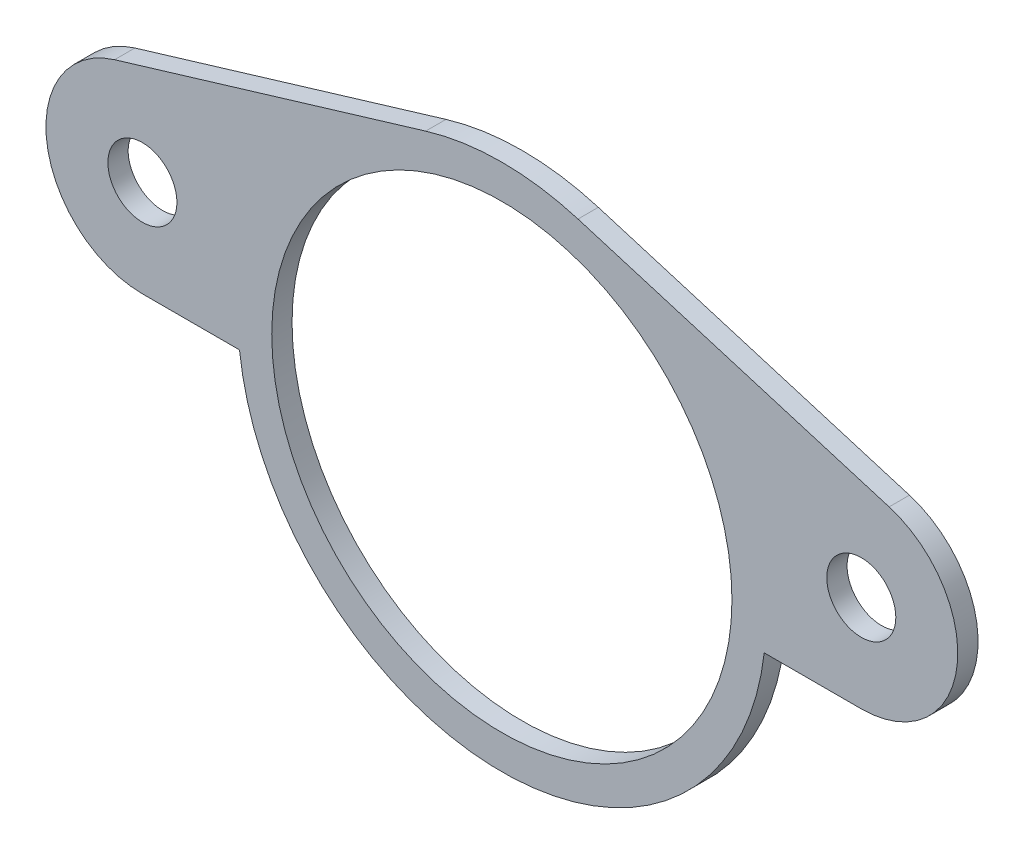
ISO-10303-21;
HEADER;
FILE_DESCRIPTION(('STEP AP214'),'2;1');
FILE_NAME('part.step','',(''),(''),'','','');
FILE_SCHEMA(('AUTOMOTIVE_DESIGN { 1 0 10303 214 1 1 1 1 }'));
ENDSEC;
DATA;
#1=APPLICATION_CONTEXT('core data for automotive mechanical design processes');
#2=APPLICATION_PROTOCOL_DEFINITION('international standard','automotive_design',2000,#1);
#3=PRODUCT_CONTEXT('',#1,'mechanical');
#4=PRODUCT('Part','Part','',(#3));
#5=PRODUCT_RELATED_PRODUCT_CATEGORY('part','',(#4));
#6=PRODUCT_DEFINITION_FORMATION('','',#4);
#7=PRODUCT_DEFINITION_CONTEXT('part definition',#1,'design');
#8=PRODUCT_DEFINITION('design','',#6,#7);
#9=PRODUCT_DEFINITION_SHAPE('','',#8);
#10=(LENGTH_UNIT() NAMED_UNIT(*) SI_UNIT(.MILLI.,.METRE.));
#11=(NAMED_UNIT(*) PLANE_ANGLE_UNIT() SI_UNIT($,.RADIAN.));
#12=(NAMED_UNIT(*) SI_UNIT($,.STERADIAN.) SOLID_ANGLE_UNIT());
#13=UNCERTAINTY_MEASURE_WITH_UNIT(LENGTH_MEASURE(1.E-05),#10,'distance_accuracy_value','');
#14=(GEOMETRIC_REPRESENTATION_CONTEXT(3) GLOBAL_UNCERTAINTY_ASSIGNED_CONTEXT((#13)) GLOBAL_UNIT_ASSIGNED_CONTEXT((#10,
#11,#12)) REPRESENTATION_CONTEXT('',''));
#15=CARTESIAN_POINT('',(0.,0.,0.));
#16=DIRECTION('',(0.,0.,1.));
#17=DIRECTION('',(1.,0.,0.));
#18=AXIS2_PLACEMENT_3D('',#15,#16,#17);
#19=CARTESIAN_POINT('',(-17.6978406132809,3.28427124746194,1.));
#20=DIRECTION('',(0.,0.,1.));
#21=DIRECTION('',(1.,0.,0.));
#22=AXIS2_PLACEMENT_3D('',#19,#20,#21);
#23=PLANE('',#22);
#24=CARTESIAN_POINT('',(17.6978406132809,3.28427124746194,1.));
#25=DIRECTION('',(0.,0.,1.));
#26=DIRECTION('',(1.,0.,0.));
#27=AXIS2_PLACEMENT_3D('',#24,#25,#26);
#28=CIRCLE('',#27,1.7);
#29=CARTESIAN_POINT('',(19.3978406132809,3.28427124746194,1.));
#30=VERTEX_POINT('',#29);
#31=EDGE_CURVE('E191',#30,#30,#28,.T.);
#32=ORIENTED_EDGE('',*,*,#31,.F.);
#33=EDGE_LOOP('',(#32));
#34=FACE_BOUND('',#33,.T.);
#35=CARTESIAN_POINT('',(-17.6978406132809,3.28427124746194,1.));
#36=DIRECTION('',(0.,0.,1.));
#37=DIRECTION('',(1.,0.,0.));
#38=AXIS2_PLACEMENT_3D('',#35,#36,#37);
#39=CIRCLE('',#38,4.75);
#40=CARTESIAN_POINT('',(-19.0680874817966,7.83233935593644,1.));
#41=VERTEX_POINT('',#40);
#42=CARTESIAN_POINT('',(-17.6978406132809,-1.46572875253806,1.));
#43=VERTEX_POINT('',#42);
#44=EDGE_CURVE('E154',#41,#43,#39,.T.);
#45=ORIENTED_EDGE('',*,*,#44,.T.);
#46=DIRECTION('',(1.,0.,0.));
#47=VECTOR('',#46,1.);
#48=CARTESIAN_POINT('',(-12.9171064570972,-1.46572875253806,1.));
#49=LINE('',#48,#47);
#50=CARTESIAN_POINT('',(-12.9171064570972,-1.46572875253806,1.));
#51=VERTEX_POINT('',#50);
#52=EDGE_CURVE('E102',#43,#51,#49,.T.);
#53=ORIENTED_EDGE('',*,*,#52,.T.);
#54=CARTESIAN_POINT('',(0.,0.,1.));
#55=DIRECTION('',(0.,0.,1.));
#56=DIRECTION('',(-1.,0.,0.));
#57=AXIS2_PLACEMENT_3D('',#54,#55,#56);
#58=CIRCLE('',#57,13.);
#59=CARTESIAN_POINT('',(12.9171064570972,-1.46572875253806,1.));
#60=VERTEX_POINT('',#59);
#61=EDGE_CURVE('E169',#51,#60,#58,.T.);
#62=ORIENTED_EDGE('',*,*,#61,.T.);
#63=DIRECTION('',(1.,0.,0.));
#64=VECTOR('',#63,1.);
#65=CARTESIAN_POINT('',(12.9171064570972,-1.46572875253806,1.));
#66=LINE('',#65,#64);
#67=CARTESIAN_POINT('',(17.6978406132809,-1.46572875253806,1.));
#68=VERTEX_POINT('',#67);
#69=EDGE_CURVE('E182',#60,#68,#66,.T.);
#70=ORIENTED_EDGE('',*,*,#69,.T.);
#71=CARTESIAN_POINT('',(17.6978406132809,3.28427124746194,1.));
#72=DIRECTION('',(0.,0.,1.));
#73=DIRECTION('',(-1.,0.,0.));
#74=AXIS2_PLACEMENT_3D('',#71,#72,#73);
#75=CIRCLE('',#74,4.75);
#76=CARTESIAN_POINT('',(19.0680874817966,7.83233935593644,1.));
#77=VERTEX_POINT('',#76);
#78=EDGE_CURVE('E121',#68,#77,#75,.T.);
#79=ORIENTED_EDGE('',*,*,#78,.T.);
#80=DIRECTION('',(-0.957488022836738,0.288473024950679,0.));
#81=VECTOR('',#80,1.);
#82=CARTESIAN_POINT('',(3.75014932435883,12.4473442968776,1.));
#83=LINE('',#82,#81);
#84=CARTESIAN_POINT('',(3.75014932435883,12.4473442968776,1.));
#85=VERTEX_POINT('',#84);
#86=EDGE_CURVE('E115',#77,#85,#83,.T.);
#87=ORIENTED_EDGE('',*,*,#86,.T.);
#88=CARTESIAN_POINT('',(0.,0.,1.));
#89=DIRECTION('',(0.,0.,1.));
#90=DIRECTION('',(-1.,0.,0.));
#91=AXIS2_PLACEMENT_3D('',#88,#89,#90);
#92=CIRCLE('',#91,13.);
#93=CARTESIAN_POINT('',(-3.75014932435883,12.4473442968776,1.));
#94=VERTEX_POINT('',#93);
#95=EDGE_CURVE('E119',#85,#94,#92,.T.);
#96=ORIENTED_EDGE('',*,*,#95,.T.);
#97=DIRECTION('',(-0.957488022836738,-0.288473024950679,0.));
#98=VECTOR('',#97,1.);
#99=CARTESIAN_POINT('',(-19.0680874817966,7.83233935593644,1.));
#100=LINE('',#99,#98);
#101=EDGE_CURVE('E59',#94,#41,#100,.T.);
#102=ORIENTED_EDGE('',*,*,#101,.T.);
#103=EDGE_LOOP('',(#45,#53,#62,#70,#79,#87,#96,#102));
#104=FACE_BOUND('',#103,.T.);
#105=CARTESIAN_POINT('',(-17.6978406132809,3.28427124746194,1.));
#106=DIRECTION('',(0.,0.,1.));
#107=DIRECTION('',(1.,0.,0.));
#108=AXIS2_PLACEMENT_3D('',#105,#106,#107);
#109=CIRCLE('',#108,1.7);
#110=CARTESIAN_POINT('',(-15.9978406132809,3.28427124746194,1.));
#111=VERTEX_POINT('',#110);
#112=EDGE_CURVE('E143',#111,#111,#109,.T.);
#113=ORIENTED_EDGE('',*,*,#112,.F.);
#114=EDGE_LOOP('',(#113));
#115=FACE_BOUND('',#114,.T.);
#116=CARTESIAN_POINT('',(0.,0.,1.));
#117=DIRECTION('',(0.,0.,1.));
#118=DIRECTION('',(1.,0.,0.));
#119=AXIS2_PLACEMENT_3D('',#116,#117,#118);
#120=CIRCLE('',#119,11.33);
#121=CARTESIAN_POINT('',(11.33,0.,1.));
#122=VERTEX_POINT('',#121);
#123=EDGE_CURVE('E197',#122,#122,#120,.T.);
#124=ORIENTED_EDGE('',*,*,#123,.F.);
#125=EDGE_LOOP('',(#124));
#126=FACE_BOUND('',#125,.T.);
#127=ADVANCED_FACE('F42',(#34,#104,#115,#126),#23,.T.);
#128=CARTESIAN_POINT('',(-17.6978406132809,3.28427124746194,0.));
#129=DIRECTION('',(0.,0.,1.));
#130=DIRECTION('',(1.,0.,0.));
#131=AXIS2_PLACEMENT_3D('',#128,#129,#130);
#132=PLANE('',#131);
#133=CARTESIAN_POINT('',(-17.6978406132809,3.28427124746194,0.));
#134=DIRECTION('',(0.,0.,1.));
#135=DIRECTION('',(1.,0.,0.));
#136=AXIS2_PLACEMENT_3D('',#133,#134,#135);
#137=CIRCLE('',#136,4.75);
#138=CARTESIAN_POINT('',(-19.0680874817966,7.83233935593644,0.));
#139=VERTEX_POINT('',#138);
#140=CARTESIAN_POINT('',(-17.6978406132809,-1.46572875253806,0.));
#141=VERTEX_POINT('',#140);
#142=EDGE_CURVE('E139',#139,#141,#137,.T.);
#143=ORIENTED_EDGE('',*,*,#142,.F.);
#144=DIRECTION('',(-0.957488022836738,-0.288473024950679,0.));
#145=VECTOR('',#144,1.);
#146=CARTESIAN_POINT('',(-19.0680874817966,7.83233935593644,0.));
#147=LINE('',#146,#145);
#148=CARTESIAN_POINT('',(-3.75014932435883,12.4473442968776,0.));
#149=VERTEX_POINT('',#148);
#150=EDGE_CURVE('E94',#149,#139,#147,.T.);
#151=ORIENTED_EDGE('',*,*,#150,.F.);
#152=CARTESIAN_POINT('',(0.,0.,0.));
#153=DIRECTION('',(0.,0.,1.));
#154=DIRECTION('',(-1.,0.,0.));
#155=AXIS2_PLACEMENT_3D('',#152,#153,#154);
#156=CIRCLE('',#155,13.);
#157=CARTESIAN_POINT('',(3.75014932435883,12.4473442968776,0.));
#158=VERTEX_POINT('',#157);
#159=EDGE_CURVE('E88',#158,#149,#156,.T.);
#160=ORIENTED_EDGE('',*,*,#159,.F.);
#161=DIRECTION('',(-0.957488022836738,0.288473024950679,0.));
#162=VECTOR('',#161,1.);
#163=CARTESIAN_POINT('',(3.75014932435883,12.4473442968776,0.));
#164=LINE('',#163,#162);
#165=CARTESIAN_POINT('',(19.0680874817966,7.83233935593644,0.));
#166=VERTEX_POINT('',#165);
#167=EDGE_CURVE('E129',#166,#158,#164,.T.);
#168=ORIENTED_EDGE('',*,*,#167,.F.);
#169=CARTESIAN_POINT('',(17.6978406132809,3.28427124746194,0.));
#170=DIRECTION('',(0.,0.,1.));
#171=DIRECTION('',(-1.,0.,0.));
#172=AXIS2_PLACEMENT_3D('',#169,#170,#171);
#173=CIRCLE('',#172,4.75);
#174=CARTESIAN_POINT('',(17.6978406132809,-1.46572875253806,0.));
#175=VERTEX_POINT('',#174);
#176=EDGE_CURVE('E149',#175,#166,#173,.T.);
#177=ORIENTED_EDGE('',*,*,#176,.F.);
#178=DIRECTION('',(1.,0.,0.));
#179=VECTOR('',#178,1.);
#180=CARTESIAN_POINT('',(12.9171064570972,-1.46572875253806,0.));
#181=LINE('',#180,#179);
#182=CARTESIAN_POINT('',(12.9171064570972,-1.46572875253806,0.));
#183=VERTEX_POINT('',#182);
#184=EDGE_CURVE('E147',#183,#175,#181,.T.);
#185=ORIENTED_EDGE('',*,*,#184,.F.);
#186=CARTESIAN_POINT('',(0.,0.,0.));
#187=DIRECTION('',(0.,0.,1.));
#188=DIRECTION('',(-1.,0.,0.));
#189=AXIS2_PLACEMENT_3D('',#186,#187,#188);
#190=CIRCLE('',#189,13.);
#191=CARTESIAN_POINT('',(-12.9171064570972,-1.46572875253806,0.));
#192=VERTEX_POINT('',#191);
#193=EDGE_CURVE('E145',#192,#183,#190,.T.);
#194=ORIENTED_EDGE('',*,*,#193,.F.);
#195=DIRECTION('',(1.,0.,0.));
#196=VECTOR('',#195,1.);
#197=CARTESIAN_POINT('',(-12.9171064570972,-1.46572875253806,0.));
#198=LINE('',#197,#196);
#199=EDGE_CURVE('E142',#141,#192,#198,.T.);
#200=ORIENTED_EDGE('',*,*,#199,.F.);
#201=EDGE_LOOP('',(#143,#151,#160,#168,#177,#185,#194,#200));
#202=FACE_BOUND('',#201,.T.);
#203=CARTESIAN_POINT('',(-17.6978406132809,3.28427124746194,0.));
#204=DIRECTION('',(0.,0.,1.));
#205=DIRECTION('',(1.,0.,0.));
#206=AXIS2_PLACEMENT_3D('',#203,#204,#205);
#207=CIRCLE('',#206,1.7);
#208=CARTESIAN_POINT('',(-15.9978406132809,3.28427124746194,0.));
#209=VERTEX_POINT('',#208);
#210=EDGE_CURVE('E188',#209,#209,#207,.T.);
#211=ORIENTED_EDGE('',*,*,#210,.T.);
#212=EDGE_LOOP('',(#211));
#213=FACE_BOUND('',#212,.T.);
#214=CARTESIAN_POINT('',(17.6978406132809,3.28427124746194,0.));
#215=DIRECTION('',(0.,0.,1.));
#216=DIRECTION('',(1.,0.,0.));
#217=AXIS2_PLACEMENT_3D('',#214,#215,#216);
#218=CIRCLE('',#217,1.7);
#219=CARTESIAN_POINT('',(19.3978406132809,3.28427124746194,0.));
#220=VERTEX_POINT('',#219);
#221=EDGE_CURVE('E194',#220,#220,#218,.T.);
#222=ORIENTED_EDGE('',*,*,#221,.T.);
#223=EDGE_LOOP('',(#222));
#224=FACE_BOUND('',#223,.T.);
#225=CARTESIAN_POINT('',(0.,0.,0.));
#226=DIRECTION('',(0.,0.,1.));
#227=DIRECTION('',(1.,0.,0.));
#228=AXIS2_PLACEMENT_3D('',#225,#226,#227);
#229=CIRCLE('',#228,11.33);
#230=CARTESIAN_POINT('',(11.33,0.,0.));
#231=VERTEX_POINT('',#230);
#232=EDGE_CURVE('E200',#231,#231,#229,.T.);
#233=ORIENTED_EDGE('',*,*,#232,.T.);
#234=EDGE_LOOP('',(#233));
#235=FACE_BOUND('',#234,.T.);
#236=ADVANCED_FACE('F173',(#202,#213,#224,#235),#132,.F.);
#237=CARTESIAN_POINT('',(-17.6978406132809,3.28427124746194,1.));
#238=DIRECTION('',(0.,0.,-1.));
#239=DIRECTION('',(-1.,0.,0.));
#240=AXIS2_PLACEMENT_3D('',#237,#238,#239);
#241=CYLINDRICAL_SURFACE('',#240,4.75);
#242=ORIENTED_EDGE('',*,*,#142,.T.);
#243=DIRECTION('',(0.,0.,-1.));
#244=VECTOR('',#243,1.);
#245=CARTESIAN_POINT('',(-17.6978406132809,-1.46572875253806,1.));
#246=LINE('',#245,#244);
#247=EDGE_CURVE('E11',#43,#141,#246,.T.);
#248=ORIENTED_EDGE('',*,*,#247,.F.);
#249=ORIENTED_EDGE('',*,*,#44,.F.);
#250=DIRECTION('',(0.,0.,-1.));
#251=VECTOR('',#250,1.);
#252=CARTESIAN_POINT('',(-19.0680874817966,7.83233935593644,1.));
#253=LINE('',#252,#251);
#254=EDGE_CURVE('E135',#41,#139,#253,.T.);
#255=ORIENTED_EDGE('',*,*,#254,.T.);
#256=EDGE_LOOP('',(#242,#248,#249,#255));
#257=FACE_BOUND('',#256,.T.);
#258=ADVANCED_FACE('F44',(#257),#241,.T.);
#259=CARTESIAN_POINT('',(-12.9171064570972,-1.46572875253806,1.));
#260=DIRECTION('',(0.,1.,0.));
#261=DIRECTION('',(-1.,0.,0.));
#262=AXIS2_PLACEMENT_3D('',#259,#260,#261);
#263=PLANE('',#262);
#264=ORIENTED_EDGE('',*,*,#199,.T.);
#265=DIRECTION('',(0.,0.,-1.));
#266=VECTOR('',#265,1.);
#267=CARTESIAN_POINT('',(-12.9171064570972,-1.46572875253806,1.));
#268=LINE('',#267,#266);
#269=EDGE_CURVE('E51',#51,#192,#268,.T.);
#270=ORIENTED_EDGE('',*,*,#269,.F.);
#271=ORIENTED_EDGE('',*,*,#52,.F.);
#272=ORIENTED_EDGE('',*,*,#247,.T.);
#273=EDGE_LOOP('',(#264,#270,#271,#272));
#274=FACE_BOUND('',#273,.T.);
#275=ADVANCED_FACE('F233',(#274),#263,.F.);
#276=CARTESIAN_POINT('',(0.,0.,1.));
#277=DIRECTION('',(0.,0.,-1.));
#278=DIRECTION('',(-1.,0.,0.));
#279=AXIS2_PLACEMENT_3D('',#276,#277,#278);
#280=CYLINDRICAL_SURFACE('',#279,13.);
#281=ORIENTED_EDGE('',*,*,#193,.T.);
#282=DIRECTION('',(0.,0.,-1.));
#283=VECTOR('',#282,1.);
#284=CARTESIAN_POINT('',(12.9171064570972,-1.46572875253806,1.));
#285=LINE('',#284,#283);
#286=EDGE_CURVE('E161',#60,#183,#285,.T.);
#287=ORIENTED_EDGE('',*,*,#286,.F.);
#288=ORIENTED_EDGE('',*,*,#61,.F.);
#289=ORIENTED_EDGE('',*,*,#269,.T.);
#290=EDGE_LOOP('',(#281,#287,#288,#289));
#291=FACE_BOUND('',#290,.T.);
#292=ADVANCED_FACE('F167',(#291),#280,.T.);
#293=CARTESIAN_POINT('',(12.9171064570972,-1.46572875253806,1.));
#294=DIRECTION('',(0.,1.,0.));
#295=DIRECTION('',(-1.,0.,0.));
#296=AXIS2_PLACEMENT_3D('',#293,#294,#295);
#297=PLANE('',#296);
#298=ORIENTED_EDGE('',*,*,#184,.T.);
#299=DIRECTION('',(0.,0.,-1.));
#300=VECTOR('',#299,1.);
#301=CARTESIAN_POINT('',(17.6978406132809,-1.46572875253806,1.));
#302=LINE('',#301,#300);
#303=EDGE_CURVE('E158',#68,#175,#302,.T.);
#304=ORIENTED_EDGE('',*,*,#303,.F.);
#305=ORIENTED_EDGE('',*,*,#69,.F.);
#306=ORIENTED_EDGE('',*,*,#286,.T.);
#307=EDGE_LOOP('',(#298,#304,#305,#306));
#308=FACE_BOUND('',#307,.T.);
#309=ADVANCED_FACE('F178',(#308),#297,.F.);
#310=CARTESIAN_POINT('',(17.6978406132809,3.28427124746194,1.));
#311=DIRECTION('',(0.,0.,-1.));
#312=DIRECTION('',(-1.,0.,0.));
#313=AXIS2_PLACEMENT_3D('',#310,#311,#312);
#314=CYLINDRICAL_SURFACE('',#313,4.75);
#315=ORIENTED_EDGE('',*,*,#176,.T.);
#316=DIRECTION('',(0.,0.,-1.));
#317=VECTOR('',#316,1.);
#318=CARTESIAN_POINT('',(19.0680874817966,7.83233935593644,1.));
#319=LINE('',#318,#317);
#320=EDGE_CURVE('E130',#77,#166,#319,.T.);
#321=ORIENTED_EDGE('',*,*,#320,.F.);
#322=ORIENTED_EDGE('',*,*,#78,.F.);
#323=ORIENTED_EDGE('',*,*,#303,.T.);
#324=EDGE_LOOP('',(#315,#321,#322,#323));
#325=FACE_BOUND('',#324,.T.);
#326=ADVANCED_FACE('F181',(#325),#314,.T.);
#327=CARTESIAN_POINT('',(3.75014932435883,12.4473442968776,1.));
#328=DIRECTION('',(-0.288473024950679,-0.957488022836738,0.));
#329=DIRECTION('',(0.957488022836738,-0.288473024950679,0.));
#330=AXIS2_PLACEMENT_3D('',#327,#328,#329);
#331=PLANE('',#330);
#332=ORIENTED_EDGE('',*,*,#167,.T.);
#333=DIRECTION('',(0.,0.,-1.));
#334=VECTOR('',#333,1.);
#335=CARTESIAN_POINT('',(3.75014932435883,12.4473442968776,1.));
#336=LINE('',#335,#334);
#337=EDGE_CURVE('E126',#85,#158,#336,.T.);
#338=ORIENTED_EDGE('',*,*,#337,.F.);
#339=ORIENTED_EDGE('',*,*,#86,.F.);
#340=ORIENTED_EDGE('',*,*,#320,.T.);
#341=EDGE_LOOP('',(#332,#338,#339,#340));
#342=FACE_BOUND('',#341,.T.);
#343=ADVANCED_FACE('F127',(#342),#331,.F.);
#344=CARTESIAN_POINT('',(0.,0.,1.));
#345=DIRECTION('',(0.,0.,-1.));
#346=DIRECTION('',(-1.,0.,0.));
#347=AXIS2_PLACEMENT_3D('',#344,#345,#346);
#348=CYLINDRICAL_SURFACE('',#347,13.);
#349=ORIENTED_EDGE('',*,*,#159,.T.);
#350=DIRECTION('',(0.,0.,-1.));
#351=VECTOR('',#350,1.);
#352=CARTESIAN_POINT('',(-3.75014932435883,12.4473442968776,1.));
#353=LINE('',#352,#351);
#354=EDGE_CURVE('E131',#94,#149,#353,.T.);
#355=ORIENTED_EDGE('',*,*,#354,.F.);
#356=ORIENTED_EDGE('',*,*,#95,.F.);
#357=ORIENTED_EDGE('',*,*,#337,.T.);
#358=EDGE_LOOP('',(#349,#355,#356,#357));
#359=FACE_BOUND('',#358,.T.);
#360=ADVANCED_FACE('F133',(#359),#348,.T.);
#361=CARTESIAN_POINT('',(-19.0680874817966,7.83233935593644,1.));
#362=DIRECTION('',(0.288473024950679,-0.957488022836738,0.));
#363=DIRECTION('',(0.957488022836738,0.288473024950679,0.));
#364=AXIS2_PLACEMENT_3D('',#361,#362,#363);
#365=PLANE('',#364);
#366=ORIENTED_EDGE('',*,*,#150,.T.);
#367=ORIENTED_EDGE('',*,*,#254,.F.);
#368=ORIENTED_EDGE('',*,*,#101,.F.);
#369=ORIENTED_EDGE('',*,*,#354,.T.);
#370=EDGE_LOOP('',(#366,#367,#368,#369));
#371=FACE_BOUND('',#370,.T.);
#372=ADVANCED_FACE('F221',(#371),#365,.F.);
#373=CARTESIAN_POINT('',(-17.6978406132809,3.28427124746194,1.));
#374=DIRECTION('',(0.,0.,-1.));
#375=DIRECTION('',(-1.,0.,0.));
#376=AXIS2_PLACEMENT_3D('',#373,#374,#375);
#377=CYLINDRICAL_SURFACE('',#376,1.7);
#378=ORIENTED_EDGE('',*,*,#112,.T.);
#379=EDGE_LOOP('',(#378));
#380=FACE_BOUND('',#379,.T.);
#381=ORIENTED_EDGE('',*,*,#210,.F.);
#382=EDGE_LOOP('',(#381));
#383=FACE_BOUND('',#382,.T.);
#384=ADVANCED_FACE('F218',(#380,#383),#377,.F.);
#385=CARTESIAN_POINT('',(17.6978406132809,3.28427124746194,1.));
#386=DIRECTION('',(0.,0.,-1.));
#387=DIRECTION('',(-1.,0.,0.));
#388=AXIS2_PLACEMENT_3D('',#385,#386,#387);
#389=CYLINDRICAL_SURFACE('',#388,1.7);
#390=ORIENTED_EDGE('',*,*,#31,.T.);
#391=EDGE_LOOP('',(#390));
#392=FACE_BOUND('',#391,.T.);
#393=ORIENTED_EDGE('',*,*,#221,.F.);
#394=EDGE_LOOP('',(#393));
#395=FACE_BOUND('',#394,.T.);
#396=ADVANCED_FACE('F296',(#392,#395),#389,.F.);
#397=CARTESIAN_POINT('',(0.,0.,1.));
#398=DIRECTION('',(0.,0.,-1.));
#399=DIRECTION('',(-1.,0.,0.));
#400=AXIS2_PLACEMENT_3D('',#397,#398,#399);
#401=CYLINDRICAL_SURFACE('',#400,11.33);
#402=ORIENTED_EDGE('',*,*,#123,.T.);
#403=EDGE_LOOP('',(#402));
#404=FACE_BOUND('',#403,.T.);
#405=ORIENTED_EDGE('',*,*,#232,.F.);
#406=EDGE_LOOP('',(#405));
#407=FACE_BOUND('',#406,.T.);
#408=ADVANCED_FACE('F206',(#404,#407),#401,.F.);
#409=CLOSED_SHELL('',(#127,#236,#258,#275,#292,#309,#326,#343,#360,#372,#384,#396,#408));
#410=MANIFOLD_SOLID_BREP('B2',#409);
#411=ADVANCED_BREP_SHAPE_REPRESENTATION('',(#18,#410),#14);
#412=SHAPE_DEFINITION_REPRESENTATION(#9,#411);
ENDSEC;
END-ISO-10303-21;
